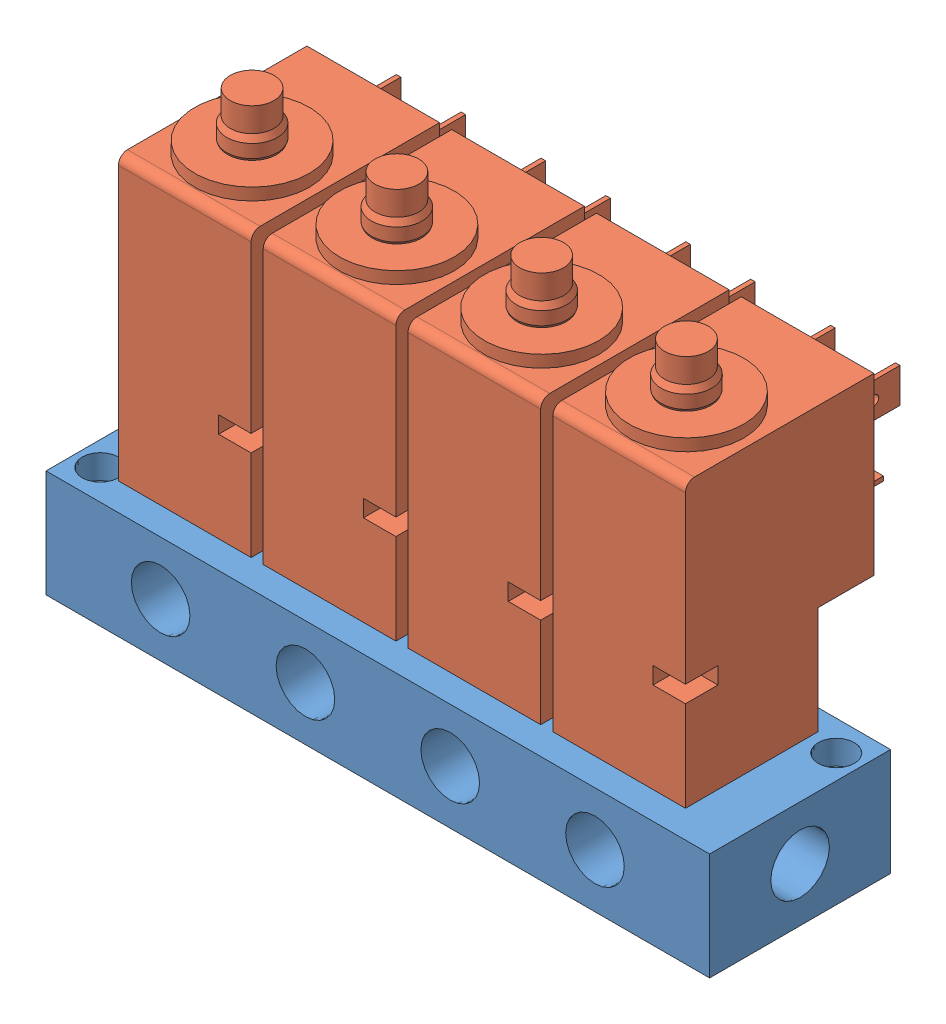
SolidWorks assembly Norgren-DM49MDZ83JT4.SLDASM, configuration Default (file format 8000). Lengths in mm.
Overall size (110 74.5 45).
5 component instances, 2 part files, 0 mates.
Components (placement in the parent):
- Norgren-DM49MDZ83JT4_4 station base-1: Norgren-DM49MDZ83JT4_4 station base.sldprt [Default] x (1 0 0) z (0 1 0) size (110 30 17.8)
- Norgren-DM49MDZ83JT4_Imported2-1: Norgren-DM49MDZ83JT4_Imported2.sldprt [Default] at (29.81 18.1716 -26.19) x (-1 0 0) z (0 1 0) size (22 40.81 60.99)
- Norgren-DM49MDZ83JT4_Imported2-2: Norgren-DM49MDZ83JT4_Imported2.sldprt [Default] at (53.81 18.1716 -26.19) x (-1 0 0) z (0 1 0) size (22 40.81 60.99)
- Norgren-DM49MDZ83JT4_Imported2-3: Norgren-DM49MDZ83JT4_Imported2.sldprt [Default] at (101.81 18.1716 -26.19) x (-1 0 0) z (0 1 0) size (22 40.81 60.99)
- Norgren-DM49MDZ83JT4_Imported2-4: Norgren-DM49MDZ83JT4_Imported2.sldprt [Default] at (77.81 18.1716 -26.19) x (-1 0 0) z (0 1 0) size (22 40.81 60.99)
